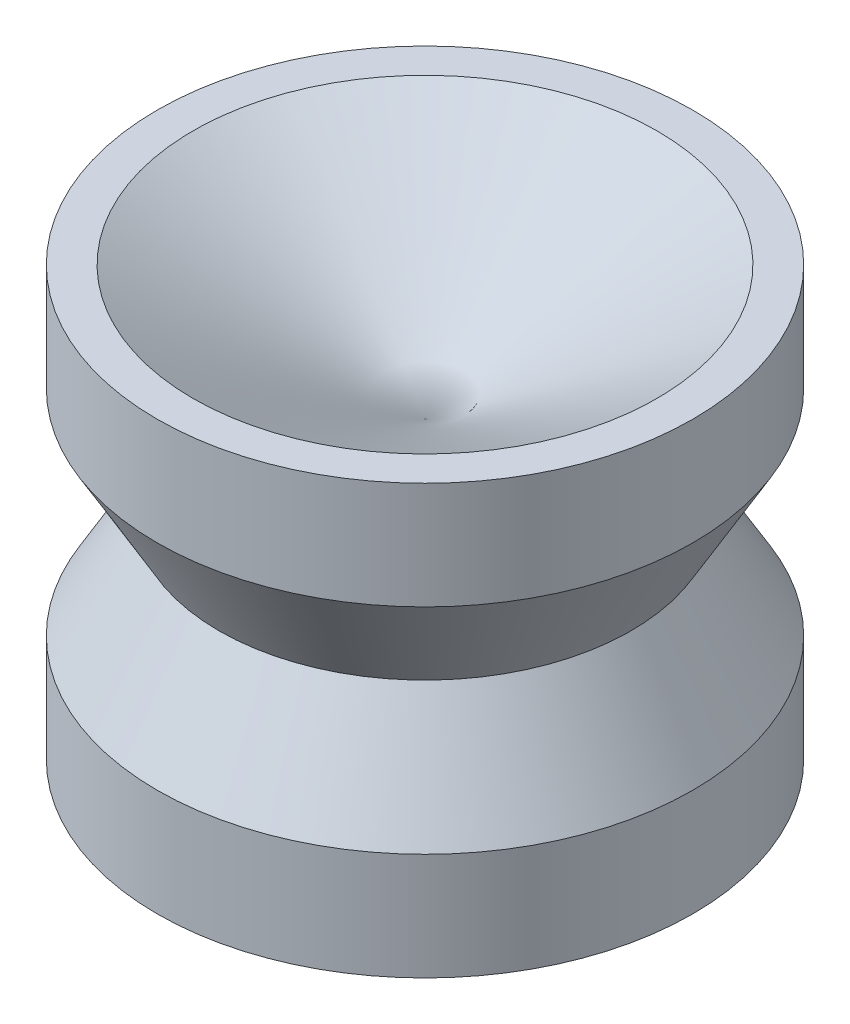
ISO-10303-21;
HEADER;
FILE_DESCRIPTION(('STEP AP214'),'2;1');
FILE_NAME('part.step','',(''),(''),'','','');
FILE_SCHEMA(('AUTOMOTIVE_DESIGN { 1 0 10303 214 1 1 1 1 }'));
ENDSEC;
DATA;
#1=APPLICATION_CONTEXT('core data for automotive mechanical design processes');
#2=APPLICATION_PROTOCOL_DEFINITION('international standard','automotive_design',2000,#1);
#3=PRODUCT_CONTEXT('',#1,'mechanical');
#4=PRODUCT('Part','Part','',(#3));
#5=PRODUCT_RELATED_PRODUCT_CATEGORY('part','',(#4));
#6=PRODUCT_DEFINITION_FORMATION('','',#4);
#7=PRODUCT_DEFINITION_CONTEXT('part definition',#1,'design');
#8=PRODUCT_DEFINITION('design','',#6,#7);
#9=PRODUCT_DEFINITION_SHAPE('','',#8);
#10=(LENGTH_UNIT() NAMED_UNIT(*) SI_UNIT(.MILLI.,.METRE.));
#11=(NAMED_UNIT(*) PLANE_ANGLE_UNIT() SI_UNIT($,.RADIAN.));
#12=(NAMED_UNIT(*) SI_UNIT($,.STERADIAN.) SOLID_ANGLE_UNIT());
#13=UNCERTAINTY_MEASURE_WITH_UNIT(LENGTH_MEASURE(1.E-05),#10,'distance_accuracy_value','');
#14=(GEOMETRIC_REPRESENTATION_CONTEXT(3) GLOBAL_UNCERTAINTY_ASSIGNED_CONTEXT((#13)) GLOBAL_UNIT_ASSIGNED_CONTEXT((#10,
#11,#12)) REPRESENTATION_CONTEXT('',''));
#15=CARTESIAN_POINT('',(0.,0.,0.));
#16=DIRECTION('',(0.,0.,1.));
#17=DIRECTION('',(1.,0.,0.));
#18=AXIS2_PLACEMENT_3D('',#15,#16,#17);
#19=CARTESIAN_POINT('',(0.,50.,0.));
#20=DIRECTION('',(0.,1.,0.));
#21=DIRECTION('',(0.,0.,1.));
#22=AXIS2_PLACEMENT_3D('',#19,#20,#21);
#23=CYLINDRICAL_SURFACE('',#22,2.5);
#24=CARTESIAN_POINT('',(0.,1.,0.));
#25=DIRECTION('',(0.,1.,0.));
#26=DIRECTION('',(0.,0.,1.));
#27=AXIS2_PLACEMENT_3D('',#24,#25,#26);
#28=CIRCLE('',#27,2.5);
#29=CARTESIAN_POINT('',(0.,1.,2.5));
#30=VERTEX_POINT('',#29);
#31=EDGE_CURVE('E55',#30,#30,#28,.T.);
#32=ORIENTED_EDGE('',*,*,#31,.T.);
#33=EDGE_LOOP('',(#32));
#34=FACE_BOUND('',#33,.T.);
#35=CARTESIAN_POINT('',(0.,2.,0.));
#36=DIRECTION('',(0.,1.,0.));
#37=DIRECTION('',(0.,0.,1.));
#38=AXIS2_PLACEMENT_3D('',#35,#36,#37);
#39=CIRCLE('',#38,2.5);
#40=CARTESIAN_POINT('',(0.,2.,2.5));
#41=VERTEX_POINT('',#40);
#42=EDGE_CURVE('E11',#41,#41,#39,.T.);
#43=ORIENTED_EDGE('',*,*,#42,.F.);
#44=EDGE_LOOP('',(#43));
#45=FACE_BOUND('',#44,.T.);
#46=ADVANCED_FACE('F34',(#34,#45),#23,.T.);
#47=CARTESIAN_POINT('',(0.,2.,0.));
#48=DIRECTION('',(0.,1.,0.));
#49=DIRECTION('',(0.,0.,1.));
#50=AXIS2_PLACEMENT_3D('',#47,#48,#49);
#51=PLANE('',#50);
#52=CARTESIAN_POINT('',(0.,2.,0.));
#53=DIRECTION('',(0.,1.,0.));
#54=DIRECTION('',(0.,0.,1.));
#55=AXIS2_PLACEMENT_3D('',#52,#53,#54);
#56=CIRCLE('',#55,2.1650635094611);
#57=CARTESIAN_POINT('',(0.,2.,2.1650635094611));
#58=VERTEX_POINT('',#57);
#59=EDGE_CURVE('E52',#58,#58,#56,.T.);
#60=ORIENTED_EDGE('',*,*,#59,.F.);
#61=EDGE_LOOP('',(#60));
#62=FACE_BOUND('',#61,.T.);
#63=ORIENTED_EDGE('',*,*,#42,.T.);
#64=EDGE_LOOP('',(#63));
#65=FACE_BOUND('',#64,.T.);
#66=ADVANCED_FACE('F36',(#62,#65),#51,.T.);
#67=CARTESIAN_POINT('',(0.,0.,0.));
#68=DIRECTION('',(0.,1.,0.));
#69=DIRECTION('',(0.,0.,1.));
#70=AXIS2_PLACEMENT_3D('',#67,#68,#69);
#71=CONICAL_SURFACE('',#70,1.92264973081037,0.523598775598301);
#72=ORIENTED_EDGE('',*,*,#31,.F.);
#73=EDGE_LOOP('',(#72));
#74=FACE_BOUND('',#73,.T.);
#75=CARTESIAN_POINT('',(0.,0.,0.));
#76=DIRECTION('',(0.,1.,0.));
#77=DIRECTION('',(0.,0.,1.));
#78=AXIS2_PLACEMENT_3D('',#75,#76,#77);
#79=CIRCLE('',#78,1.92264973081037);
#80=CARTESIAN_POINT('',(0.,0.,1.92264973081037));
#81=VERTEX_POINT('',#80);
#82=EDGE_CURVE('E66',#81,#81,#79,.T.);
#83=ORIENTED_EDGE('',*,*,#82,.T.);
#84=EDGE_LOOP('',(#83));
#85=FACE_BOUND('',#84,.T.);
#86=ADVANCED_FACE('F84',(#74,#85),#71,.T.);
#87=CARTESIAN_POINT('',(0.,-1.,0.));
#88=DIRECTION('',(0.,-1.,0.));
#89=DIRECTION('',(0.,0.,-1.));
#90=AXIS2_PLACEMENT_3D('',#87,#88,#89);
#91=CONICAL_SURFACE('',#90,2.5,0.5235987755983);
#92=ORIENTED_EDGE('',*,*,#82,.F.);
#93=EDGE_LOOP('',(#92));
#94=FACE_BOUND('',#93,.T.);
#95=CARTESIAN_POINT('',(0.,-1.,0.));
#96=DIRECTION('',(0.,1.,0.));
#97=DIRECTION('',(0.,0.,1.));
#98=AXIS2_PLACEMENT_3D('',#95,#96,#97);
#99=CIRCLE('',#98,2.5);
#100=CARTESIAN_POINT('',(0.,-1.,2.5));
#101=VERTEX_POINT('',#100);
#102=EDGE_CURVE('E60',#101,#101,#99,.T.);
#103=ORIENTED_EDGE('',*,*,#102,.T.);
#104=EDGE_LOOP('',(#103));
#105=FACE_BOUND('',#104,.T.);
#106=ADVANCED_FACE('F77',(#94,#105),#91,.T.);
#107=CARTESIAN_POINT('',(-2.5,-2.,0.));
#108=DIRECTION('',(0.,-1.,0.));
#109=DIRECTION('',(0.,0.,-1.));
#110=AXIS2_PLACEMENT_3D('',#107,#108,#109);
#111=PLANE('',#110);
#112=CARTESIAN_POINT('',(0.,-2.,0.));
#113=DIRECTION('',(0.,1.,0.));
#114=DIRECTION('',(0.,0.,1.));
#115=AXIS2_PLACEMENT_3D('',#112,#113,#114);
#116=CIRCLE('',#115,2.5);
#117=CARTESIAN_POINT('',(0.,-2.,2.5));
#118=VERTEX_POINT('',#117);
#119=EDGE_CURVE('E42',#118,#118,#116,.T.);
#120=ORIENTED_EDGE('',*,*,#119,.F.);
#121=EDGE_LOOP('',(#120));
#122=FACE_BOUND('',#121,.T.);
#123=ADVANCED_FACE('F75',(#122),#111,.T.);
#124=ORIENTED_EDGE('',*,*,#102,.F.);
#125=EDGE_LOOP('',(#124));
#126=FACE_BOUND('',#125,.T.);
#127=ORIENTED_EDGE('',*,*,#119,.T.);
#128=EDGE_LOOP('',(#127));
#129=FACE_BOUND('',#128,.T.);
#130=ADVANCED_FACE('F48',(#126,#129),#23,.T.);
#131=CARTESIAN_POINT('',(0.,2.,0.));
#132=DIRECTION('',(0.,1.,0.));
#133=DIRECTION('',(0.,0.,1.));
#134=AXIS2_PLACEMENT_3D('',#131,#132,#133);
#135=CONICAL_SURFACE('',#134,2.1650635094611,1.0471975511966);
#136=CARTESIAN_POINT('',(0.,0.75,0.));
#137=VERTEX_POINT('',#136);
#138=VERTEX_LOOP('',#137);
#139=FACE_BOUND('',#138,.T.);
#140=ORIENTED_EDGE('',*,*,#59,.T.);
#141=EDGE_LOOP('',(#140));
#142=FACE_BOUND('',#141,.T.);
#143=ADVANCED_FACE('F45',(#139,#142),#135,.F.);
#144=CLOSED_SHELL('',(#46,#66,#86,#106,#123,#130,#143));
#145=MANIFOLD_SOLID_BREP('B2',#144);
#146=ADVANCED_BREP_SHAPE_REPRESENTATION('',(#18,#145),#14);
#147=SHAPE_DEFINITION_REPRESENTATION(#9,#146);
ENDSEC;
END-ISO-10303-21;
